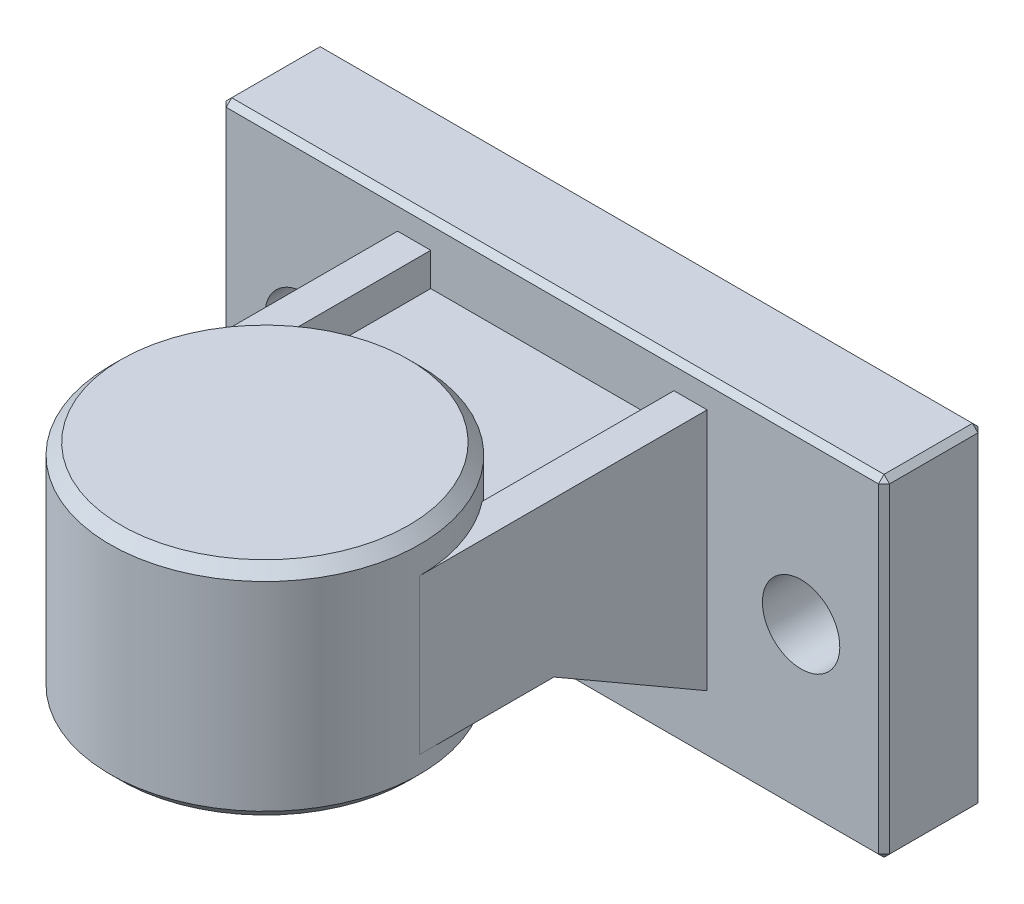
ISO-10303-21;
HEADER;
FILE_DESCRIPTION(('STEP AP214'),'2;1');
FILE_NAME('part.step','',(''),(''),'','','');
FILE_SCHEMA(('AUTOMOTIVE_DESIGN { 1 0 10303 214 1 1 1 1 }'));
ENDSEC;
DATA;
#1=APPLICATION_CONTEXT('core data for automotive mechanical design processes');
#2=APPLICATION_PROTOCOL_DEFINITION('international standard','automotive_design',2000,#1);
#3=PRODUCT_CONTEXT('',#1,'mechanical');
#4=PRODUCT('Part','Part','',(#3));
#5=PRODUCT_RELATED_PRODUCT_CATEGORY('part','',(#4));
#6=PRODUCT_DEFINITION_FORMATION('','',#4);
#7=PRODUCT_DEFINITION_CONTEXT('part definition',#1,'design');
#8=PRODUCT_DEFINITION('design','',#6,#7);
#9=PRODUCT_DEFINITION_SHAPE('','',#8);
#10=(LENGTH_UNIT() NAMED_UNIT(*) SI_UNIT(.MILLI.,.METRE.));
#11=(NAMED_UNIT(*) PLANE_ANGLE_UNIT() SI_UNIT($,.RADIAN.));
#12=(NAMED_UNIT(*) SI_UNIT($,.STERADIAN.) SOLID_ANGLE_UNIT());
#13=UNCERTAINTY_MEASURE_WITH_UNIT(LENGTH_MEASURE(1.E-05),#10,'distance_accuracy_value','');
#14=(GEOMETRIC_REPRESENTATION_CONTEXT(3) GLOBAL_UNCERTAINTY_ASSIGNED_CONTEXT((#13)) GLOBAL_UNIT_ASSIGNED_CONTEXT((#10,
#11,#12)) REPRESENTATION_CONTEXT('',''));
#15=CARTESIAN_POINT('',(0.,0.,0.));
#16=DIRECTION('',(0.,0.,1.));
#17=DIRECTION('',(1.,0.,0.));
#18=AXIS2_PLACEMENT_3D('',#15,#16,#17);
#19=CARTESIAN_POINT('',(8.5,-1.45,35.));
#20=DIRECTION('',(0.,-1.,0.));
#21=DIRECTION('',(0.,0.,1.));
#22=AXIS2_PLACEMENT_3D('',#19,#20,#21);
#23=PLANE('',#22);
#24=DIRECTION('',(0.,0.,-1.));
#25=VECTOR('',#24,1.);
#26=CARTESIAN_POINT('',(11.5,-1.45,26.3397459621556));
#27=LINE('',#26,#25);
#28=CARTESIAN_POINT('',(11.5,-1.45,26.3397459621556));
#29=VERTEX_POINT('',#28);
#30=CARTESIAN_POINT('',(11.5,-1.45,22.8564064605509));
#31=VERTEX_POINT('',#30);
#32=EDGE_CURVE('E198',#29,#31,#27,.T.);
#33=ORIENTED_EDGE('',*,*,#32,.F.);
#34=CARTESIAN_POINT('',(22.5,-1.45,35.));
#35=DIRECTION('',(0.,-1.,0.));
#36=DIRECTION('',(0.,0.,1.));
#37=AXIS2_PLACEMENT_3D('',#34,#35,#36);
#38=CIRCLE('',#37,14.);
#39=CARTESIAN_POINT('',(8.5,-1.45,35.));
#40=VERTEX_POINT('',#39);
#41=EDGE_CURVE('E215',#40,#29,#38,.T.);
#42=ORIENTED_EDGE('',*,*,#41,.F.);
#43=DIRECTION('',(0.,0.,-1.));
#44=VECTOR('',#43,1.);
#45=CARTESIAN_POINT('',(8.5,-1.45,35.));
#46=LINE('',#45,#44);
#47=CARTESIAN_POINT('',(8.5,-1.45,22.8564064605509));
#48=VERTEX_POINT('',#47);
#49=EDGE_CURVE('E238',#40,#48,#46,.T.);
#50=ORIENTED_EDGE('',*,*,#49,.T.);
#51=DIRECTION('',(-1.,0.,0.));
#52=VECTOR('',#51,1.);
#53=CARTESIAN_POINT('',(11.5,-1.45,22.8564064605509));
#54=LINE('',#53,#52);
#55=EDGE_CURVE('E216',#31,#48,#54,.T.);
#56=ORIENTED_EDGE('',*,*,#55,.F.);
#57=EDGE_LOOP('',(#33,#42,#50,#56));
#58=FACE_BOUND('',#57,.T.);
#59=ADVANCED_FACE('F14',(#58),#23,.T.);
#60=CARTESIAN_POINT('',(8.5,12.55,35.));
#61=DIRECTION('',(0.,-1.,0.));
#62=DIRECTION('',(0.,0.,1.));
#63=AXIS2_PLACEMENT_3D('',#60,#61,#62);
#64=PLANE('',#63);
#65=DIRECTION('',(0.,0.,-1.));
#66=VECTOR('',#65,1.);
#67=CARTESIAN_POINT('',(11.5,12.55,26.3397459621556));
#68=LINE('',#67,#66);
#69=CARTESIAN_POINT('',(11.5,12.55,26.3397459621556));
#70=VERTEX_POINT('',#69);
#71=CARTESIAN_POINT('',(11.5,12.55,9.));
#72=VERTEX_POINT('',#71);
#73=EDGE_CURVE('E931',#70,#72,#68,.T.);
#74=ORIENTED_EDGE('',*,*,#73,.T.);
#75=DIRECTION('',(1.,0.,0.));
#76=VECTOR('',#75,1.);
#77=CARTESIAN_POINT('',(8.5,12.55,9.));
#78=LINE('',#77,#76);
#79=CARTESIAN_POINT('',(8.5,12.55,9.));
#80=VERTEX_POINT('',#79);
#81=EDGE_CURVE('E246',#80,#72,#78,.T.);
#82=ORIENTED_EDGE('',*,*,#81,.F.);
#83=DIRECTION('',(0.,0.,-1.));
#84=VECTOR('',#83,1.);
#85=CARTESIAN_POINT('',(8.5,12.55,35.));
#86=LINE('',#85,#84);
#87=CARTESIAN_POINT('',(8.5,12.55,35.));
#88=VERTEX_POINT('',#87);
#89=EDGE_CURVE('E242',#88,#80,#86,.T.);
#90=ORIENTED_EDGE('',*,*,#89,.F.);
#91=CARTESIAN_POINT('',(22.5,12.55,35.));
#92=DIRECTION('',(0.,-1.,0.));
#93=DIRECTION('',(0.,0.,1.));
#94=AXIS2_PLACEMENT_3D('',#91,#92,#93);
#95=CIRCLE('',#94,14.);
#96=EDGE_CURVE('E225',#88,#70,#95,.T.);
#97=ORIENTED_EDGE('',*,*,#96,.T.);
#98=EDGE_LOOP('',(#74,#82,#90,#97));
#99=FACE_BOUND('',#98,.T.);
#100=ADVANCED_FACE('F476',(#99),#64,.F.);
#101=DIRECTION('',(0.,0.,1.));
#102=VECTOR('',#101,1.);
#103=CARTESIAN_POINT('',(33.5,-1.45,9.));
#104=LINE('',#103,#102);
#105=CARTESIAN_POINT('',(33.5,-1.45,22.8564064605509));
#106=VERTEX_POINT('',#105);
#107=CARTESIAN_POINT('',(33.5,-1.45,26.3397459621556));
#108=VERTEX_POINT('',#107);
#109=EDGE_CURVE('E186',#106,#108,#104,.T.);
#110=ORIENTED_EDGE('',*,*,#109,.F.);
#111=DIRECTION('',(1.,0.,0.));
#112=VECTOR('',#111,1.);
#113=CARTESIAN_POINT('',(33.5,-1.45,22.8564064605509));
#114=LINE('',#113,#112);
#115=CARTESIAN_POINT('',(36.5,-1.45,22.8564064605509));
#116=VERTEX_POINT('',#115);
#117=EDGE_CURVE('E910',#106,#116,#114,.T.);
#118=ORIENTED_EDGE('',*,*,#117,.T.);
#119=DIRECTION('',(0.,0.,-1.));
#120=VECTOR('',#119,1.);
#121=CARTESIAN_POINT('',(36.5,-1.45,35.));
#122=LINE('',#121,#120);
#123=CARTESIAN_POINT('',(36.5,-1.45,35.));
#124=VERTEX_POINT('',#123);
#125=EDGE_CURVE('E214',#124,#116,#122,.T.);
#126=ORIENTED_EDGE('',*,*,#125,.F.);
#127=EDGE_CURVE('E204',#108,#124,#38,.T.);
#128=ORIENTED_EDGE('',*,*,#127,.F.);
#129=EDGE_LOOP('',(#110,#118,#126,#128));
#130=FACE_BOUND('',#129,.T.);
#131=ADVANCED_FACE('F212',(#130),#23,.T.);
#132=CARTESIAN_POINT('',(52.5,15.,9.));
#133=DIRECTION('',(0.,0.,-1.));
#134=DIRECTION('',(0.,-1.,0.));
#135=AXIS2_PLACEMENT_3D('',#132,#133,#134);
#136=PLANE('',#135);
#137=DIRECTION('',(-1.,0.,0.));
#138=VECTOR('',#137,1.);
#139=CARTESIAN_POINT('',(-7.5,14.5,9.));
#140=LINE('',#139,#138);
#141=CARTESIAN_POINT('',(52.,14.5,9.));
#142=VERTEX_POINT('',#141);
#143=CARTESIAN_POINT('',(-7.,14.5,9.));
#144=VERTEX_POINT('',#143);
#145=EDGE_CURVE('E277',#142,#144,#140,.T.);
#146=ORIENTED_EDGE('',*,*,#145,.T.);
#147=DIRECTION('',(0.,-1.,0.));
#148=VECTOR('',#147,1.);
#149=CARTESIAN_POINT('',(-7.,15.,9.));
#150=LINE('',#149,#148);
#151=CARTESIAN_POINT('',(-7.,-14.5,9.));
#152=VERTEX_POINT('',#151);
#153=EDGE_CURVE('E279',#144,#152,#150,.T.);
#154=ORIENTED_EDGE('',*,*,#153,.T.);
#155=DIRECTION('',(1.,0.,0.));
#156=VECTOR('',#155,1.);
#157=CARTESIAN_POINT('',(52.5,-14.5,9.));
#158=LINE('',#157,#156);
#159=CARTESIAN_POINT('',(52.,-14.5,9.));
#160=VERTEX_POINT('',#159);
#161=EDGE_CURVE('E273',#152,#160,#158,.T.);
#162=ORIENTED_EDGE('',*,*,#161,.T.);
#163=DIRECTION('',(0.,1.,0.));
#164=VECTOR('',#163,1.);
#165=CARTESIAN_POINT('',(52.,15.,9.));
#166=LINE('',#165,#164);
#167=EDGE_CURVE('E275',#160,#142,#166,.T.);
#168=ORIENTED_EDGE('',*,*,#167,.T.);
#169=EDGE_LOOP('',(#146,#154,#162,#168));
#170=FACE_BOUND('',#169,.T.);
#171=CARTESIAN_POINT('',(45.,0.,9.));
#172=DIRECTION('',(0.,0.,1.));
#173=DIRECTION('',(0.,1.,0.));
#174=AXIS2_PLACEMENT_3D('',#171,#172,#173);
#175=CIRCLE('',#174,3.5);
#176=CARTESIAN_POINT('',(45.,3.5,9.));
#177=VERTEX_POINT('',#176);
#178=EDGE_CURVE('E258',#177,#177,#175,.T.);
#179=ORIENTED_EDGE('',*,*,#178,.F.);
#180=EDGE_LOOP('',(#179));
#181=FACE_BOUND('',#180,.T.);
#182=CARTESIAN_POINT('',(0.,0.,9.));
#183=DIRECTION('',(0.,0.,-1.));
#184=DIRECTION('',(0.,-1.,0.));
#185=AXIS2_PLACEMENT_3D('',#182,#183,#184);
#186=CIRCLE('',#185,3.5);
#187=CARTESIAN_POINT('',(0.,-3.5,9.));
#188=VERTEX_POINT('',#187);
#189=EDGE_CURVE('E252',#188,#188,#186,.T.);
#190=ORIENTED_EDGE('',*,*,#189,.T.);
#191=EDGE_LOOP('',(#190));
#192=FACE_BOUND('',#191,.T.);
#193=DIRECTION('',(1.,0.,0.));
#194=VECTOR('',#193,1.);
#195=CARTESIAN_POINT('',(33.5,-9.45,9.));
#196=LINE('',#195,#194);
#197=CARTESIAN_POINT('',(33.5,-9.45,9.));
#198=VERTEX_POINT('',#197);
#199=CARTESIAN_POINT('',(36.5,-9.45,9.));
#200=VERTEX_POINT('',#199);
#201=EDGE_CURVE('E903',#198,#200,#196,.T.);
#202=ORIENTED_EDGE('',*,*,#201,.F.);
#203=DIRECTION('',(0.,-1.,0.));
#204=VECTOR('',#203,1.);
#205=CARTESIAN_POINT('',(33.5,-1.45,9.));
#206=LINE('',#205,#204);
#207=CARTESIAN_POINT('',(33.5,1.55,9.));
#208=VERTEX_POINT('',#207);
#209=EDGE_CURVE('E905',#208,#198,#206,.T.);
#210=ORIENTED_EDGE('',*,*,#209,.F.);
#211=DIRECTION('',(1.,0.,0.));
#212=VECTOR('',#211,1.);
#213=CARTESIAN_POINT('',(11.5,1.55,9.));
#214=LINE('',#213,#212);
#215=CARTESIAN_POINT('',(11.5,1.55,9.));
#216=VERTEX_POINT('',#215);
#217=EDGE_CURVE('E975',#216,#208,#214,.T.);
#218=ORIENTED_EDGE('',*,*,#217,.F.);
#219=DIRECTION('',(0.,-1.,0.));
#220=VECTOR('',#219,1.);
#221=CARTESIAN_POINT('',(11.5,-1.45,9.));
#222=LINE('',#221,#220);
#223=CARTESIAN_POINT('',(11.5,-9.45,9.));
#224=VERTEX_POINT('',#223);
#225=EDGE_CURVE('E913',#216,#224,#222,.T.);
#226=ORIENTED_EDGE('',*,*,#225,.T.);
#227=DIRECTION('',(-1.,0.,0.));
#228=VECTOR('',#227,1.);
#229=CARTESIAN_POINT('',(11.5,-9.45,9.));
#230=LINE('',#229,#228);
#231=CARTESIAN_POINT('',(8.5,-9.45,9.));
#232=VERTEX_POINT('',#231);
#233=EDGE_CURVE('E221',#224,#232,#230,.T.);
#234=ORIENTED_EDGE('',*,*,#233,.T.);
#235=DIRECTION('',(0.,-1.,0.));
#236=VECTOR('',#235,1.);
#237=CARTESIAN_POINT('',(8.5,12.55,9.));
#238=LINE('',#237,#236);
#239=EDGE_CURVE('E240',#80,#232,#238,.T.);
#240=ORIENTED_EDGE('',*,*,#239,.F.);
#241=ORIENTED_EDGE('',*,*,#81,.T.);
#242=DIRECTION('',(0.,1.,0.));
#243=VECTOR('',#242,1.);
#244=CARTESIAN_POINT('',(11.5,9.55,9.));
#245=LINE('',#244,#243);
#246=CARTESIAN_POINT('',(11.5,9.55,9.));
#247=VERTEX_POINT('',#246);
#248=EDGE_CURVE('E933',#247,#72,#245,.T.);
#249=ORIENTED_EDGE('',*,*,#248,.F.);
#250=DIRECTION('',(-1.,0.,0.));
#251=VECTOR('',#250,1.);
#252=CARTESIAN_POINT('',(33.5,9.55,9.));
#253=LINE('',#252,#251);
#254=CARTESIAN_POINT('',(33.5,9.55,9.));
#255=VERTEX_POINT('',#254);
#256=EDGE_CURVE('E935',#255,#247,#253,.T.);
#257=ORIENTED_EDGE('',*,*,#256,.F.);
#258=DIRECTION('',(0.,1.,0.));
#259=VECTOR('',#258,1.);
#260=CARTESIAN_POINT('',(33.5,9.55,9.));
#261=LINE('',#260,#259);
#262=CARTESIAN_POINT('',(33.5,12.55,9.));
#263=VERTEX_POINT('',#262);
#264=EDGE_CURVE('E958',#255,#263,#261,.T.);
#265=ORIENTED_EDGE('',*,*,#264,.T.);
#266=CARTESIAN_POINT('',(36.5,12.55,9.));
#267=VERTEX_POINT('',#266);
#268=EDGE_CURVE('E245',#263,#267,#78,.T.);
#269=ORIENTED_EDGE('',*,*,#268,.T.);
#270=DIRECTION('',(0.,-1.,0.));
#271=VECTOR('',#270,1.);
#272=CARTESIAN_POINT('',(36.5,12.55,9.));
#273=LINE('',#272,#271);
#274=EDGE_CURVE('E231',#267,#200,#273,.T.);
#275=ORIENTED_EDGE('',*,*,#274,.T.);
#276=EDGE_LOOP('',(#202,#210,#218,#226,#234,#240,#241,#249,#257,#265,#269,#275));
#277=FACE_BOUND('',#276,.T.);
#278=ADVANCED_FACE('F489',(#170,#181,#192,#277),#136,.F.);
#279=CARTESIAN_POINT('',(52.5,15.,0.));
#280=DIRECTION('',(0.,0.,-1.));
#281=DIRECTION('',(0.,-1.,0.));
#282=AXIS2_PLACEMENT_3D('',#279,#280,#281);
#283=PLANE('',#282);
#284=DIRECTION('',(1.,0.,0.));
#285=VECTOR('',#284,1.);
#286=CARTESIAN_POINT('',(52.5,14.5,0.));
#287=LINE('',#286,#285);
#288=CARTESIAN_POINT('',(-7.,14.5,0.));
#289=VERTEX_POINT('',#288);
#290=CARTESIAN_POINT('',(52.,14.5,0.));
#291=VERTEX_POINT('',#290);
#292=EDGE_CURVE('E318',#289,#291,#287,.T.);
#293=ORIENTED_EDGE('',*,*,#292,.T.);
#294=DIRECTION('',(0.,-1.,0.));
#295=VECTOR('',#294,1.);
#296=CARTESIAN_POINT('',(52.,-15.,0.));
#297=LINE('',#296,#295);
#298=CARTESIAN_POINT('',(52.,-14.5,0.));
#299=VERTEX_POINT('',#298);
#300=EDGE_CURVE('E9',#291,#299,#297,.T.);
#301=ORIENTED_EDGE('',*,*,#300,.T.);
#302=DIRECTION('',(-1.,0.,0.));
#303=VECTOR('',#302,1.);
#304=CARTESIAN_POINT('',(52.5,-14.5,0.));
#305=LINE('',#304,#303);
#306=CARTESIAN_POINT('',(-7.,-14.5,0.));
#307=VERTEX_POINT('',#306);
#308=EDGE_CURVE('E23',#299,#307,#305,.T.);
#309=ORIENTED_EDGE('',*,*,#308,.T.);
#310=DIRECTION('',(0.,1.,0.));
#311=VECTOR('',#310,1.);
#312=CARTESIAN_POINT('',(-7.,15.,0.));
#313=LINE('',#312,#311);
#314=EDGE_CURVE('E320',#307,#289,#313,.T.);
#315=ORIENTED_EDGE('',*,*,#314,.T.);
#316=EDGE_LOOP('',(#293,#301,#309,#315));
#317=FACE_BOUND('',#316,.T.);
#318=CARTESIAN_POINT('',(0.,0.,0.));
#319=DIRECTION('',(0.,0.,-1.));
#320=DIRECTION('',(0.,-1.,0.));
#321=AXIS2_PLACEMENT_3D('',#318,#319,#320);
#322=CIRCLE('',#321,3.5);
#323=CARTESIAN_POINT('',(0.,-3.5,0.));
#324=VERTEX_POINT('',#323);
#325=EDGE_CURVE('E249',#324,#324,#322,.T.);
#326=ORIENTED_EDGE('',*,*,#325,.F.);
#327=EDGE_LOOP('',(#326));
#328=FACE_BOUND('',#327,.T.);
#329=CARTESIAN_POINT('',(45.,0.,0.));
#330=DIRECTION('',(0.,0.,1.));
#331=DIRECTION('',(0.,1.,0.));
#332=AXIS2_PLACEMENT_3D('',#329,#330,#331);
#333=CIRCLE('',#332,3.5);
#334=CARTESIAN_POINT('',(45.,3.5,0.));
#335=VERTEX_POINT('',#334);
#336=EDGE_CURVE('E255',#335,#335,#333,.T.);
#337=ORIENTED_EDGE('',*,*,#336,.T.);
#338=EDGE_LOOP('',(#337));
#339=FACE_BOUND('',#338,.T.);
#340=ADVANCED_FACE('F416',(#317,#328,#339),#283,.T.);
#341=CARTESIAN_POINT('',(52.5,-15.,9.));
#342=DIRECTION('',(-1.,0.,0.));
#343=DIRECTION('',(0.,-1.,0.));
#344=AXIS2_PLACEMENT_3D('',#341,#342,#343);
#345=PLANE('',#344);
#346=DIRECTION('',(0.,1.,0.));
#347=VECTOR('',#346,1.);
#348=CARTESIAN_POINT('',(52.5,15.,0.499999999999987));
#349=LINE('',#348,#347);
#350=CARTESIAN_POINT('',(52.5,-14.5,0.499999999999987));
#351=VERTEX_POINT('',#350);
#352=CARTESIAN_POINT('',(52.5,14.5,0.499999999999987));
#353=VERTEX_POINT('',#352);
#354=EDGE_CURVE('E300',#351,#353,#349,.T.);
#355=ORIENTED_EDGE('',*,*,#354,.T.);
#356=DIRECTION('',(0.,0.,1.));
#357=VECTOR('',#356,1.);
#358=CARTESIAN_POINT('',(52.5,14.5,9.));
#359=LINE('',#358,#357);
#360=CARTESIAN_POINT('',(52.5,14.5,8.5));
#361=VERTEX_POINT('',#360);
#362=EDGE_CURVE('E306',#353,#361,#359,.T.);
#363=ORIENTED_EDGE('',*,*,#362,.T.);
#364=DIRECTION('',(0.,-1.,0.));
#365=VECTOR('',#364,1.);
#366=CARTESIAN_POINT('',(52.5,-15.,8.5));
#367=LINE('',#366,#365);
#368=CARTESIAN_POINT('',(52.5,-14.5,8.5));
#369=VERTEX_POINT('',#368);
#370=EDGE_CURVE('E304',#361,#369,#367,.T.);
#371=ORIENTED_EDGE('',*,*,#370,.T.);
#372=DIRECTION('',(0.,0.,-1.));
#373=VECTOR('',#372,1.);
#374=CARTESIAN_POINT('',(52.5,-14.5,0.));
#375=LINE('',#374,#373);
#376=EDGE_CURVE('E302',#369,#351,#375,.T.);
#377=ORIENTED_EDGE('',*,*,#376,.T.);
#378=EDGE_LOOP('',(#355,#363,#371,#377));
#379=FACE_BOUND('',#378,.T.);
#380=ADVANCED_FACE('F414',(#379),#345,.F.);
#381=CARTESIAN_POINT('',(-7.5,15.,9.));
#382=DIRECTION('',(0.,1.,0.));
#383=DIRECTION('',(-1.,0.,0.));
#384=AXIS2_PLACEMENT_3D('',#381,#382,#383);
#385=PLANE('',#384);
#386=DIRECTION('',(0.,0.,1.));
#387=VECTOR('',#386,1.);
#388=CARTESIAN_POINT('',(-7.,15.,9.));
#389=LINE('',#388,#387);
#390=CARTESIAN_POINT('',(-7.,15.,0.499999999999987));
#391=VERTEX_POINT('',#390);
#392=CARTESIAN_POINT('',(-7.,15.,8.5));
#393=VERTEX_POINT('',#392);
#394=EDGE_CURVE('E293',#391,#393,#389,.T.);
#395=ORIENTED_EDGE('',*,*,#394,.T.);
#396=DIRECTION('',(1.,0.,0.));
#397=VECTOR('',#396,1.);
#398=CARTESIAN_POINT('',(52.5,15.,8.5));
#399=LINE('',#398,#397);
#400=CARTESIAN_POINT('',(52.,15.,8.5));
#401=VERTEX_POINT('',#400);
#402=EDGE_CURVE('E297',#393,#401,#399,.T.);
#403=ORIENTED_EDGE('',*,*,#402,.T.);
#404=DIRECTION('',(0.,0.,-1.));
#405=VECTOR('',#404,1.);
#406=CARTESIAN_POINT('',(52.,15.,0.));
#407=LINE('',#406,#405);
#408=CARTESIAN_POINT('',(52.,15.,0.499999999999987));
#409=VERTEX_POINT('',#408);
#410=EDGE_CURVE('E295',#401,#409,#407,.T.);
#411=ORIENTED_EDGE('',*,*,#410,.T.);
#412=DIRECTION('',(-1.,0.,0.));
#413=VECTOR('',#412,1.);
#414=CARTESIAN_POINT('',(-7.5,15.,0.499999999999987));
#415=LINE('',#414,#413);
#416=EDGE_CURVE('E291',#409,#391,#415,.T.);
#417=ORIENTED_EDGE('',*,*,#416,.T.);
#418=EDGE_LOOP('',(#395,#403,#411,#417));
#419=FACE_BOUND('',#418,.T.);
#420=ADVANCED_FACE('F405',(#419),#385,.T.);
#421=CARTESIAN_POINT('',(-7.5,15.,9.));
#422=DIRECTION('',(1.,0.,0.));
#423=DIRECTION('',(0.,1.,0.));
#424=AXIS2_PLACEMENT_3D('',#421,#422,#423);
#425=PLANE('',#424);
#426=DIRECTION('',(0.,0.,1.));
#427=VECTOR('',#426,1.);
#428=CARTESIAN_POINT('',(-7.5,-14.5,9.));
#429=LINE('',#428,#427);
#430=CARTESIAN_POINT('',(-7.5,-14.5,0.499999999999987));
#431=VERTEX_POINT('',#430);
#432=CARTESIAN_POINT('',(-7.5,-14.5,8.5));
#433=VERTEX_POINT('',#432);
#434=EDGE_CURVE('E286',#431,#433,#429,.T.);
#435=ORIENTED_EDGE('',*,*,#434,.T.);
#436=DIRECTION('',(0.,1.,0.));
#437=VECTOR('',#436,1.);
#438=CARTESIAN_POINT('',(-7.5,15.,8.5));
#439=LINE('',#438,#437);
#440=CARTESIAN_POINT('',(-7.5,14.5,8.5));
#441=VERTEX_POINT('',#440);
#442=EDGE_CURVE('E288',#433,#441,#439,.T.);
#443=ORIENTED_EDGE('',*,*,#442,.T.);
#444=DIRECTION('',(0.,0.,-1.));
#445=VECTOR('',#444,1.);
#446=CARTESIAN_POINT('',(-7.5,14.5,0.));
#447=LINE('',#446,#445);
#448=CARTESIAN_POINT('',(-7.5,14.5,0.499999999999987));
#449=VERTEX_POINT('',#448);
#450=EDGE_CURVE('E282',#441,#449,#447,.T.);
#451=ORIENTED_EDGE('',*,*,#450,.T.);
#452=DIRECTION('',(0.,-1.,0.));
#453=VECTOR('',#452,1.);
#454=CARTESIAN_POINT('',(-7.5,-15.,0.499999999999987));
#455=LINE('',#454,#453);
#456=EDGE_CURVE('E284',#449,#431,#455,.T.);
#457=ORIENTED_EDGE('',*,*,#456,.T.);
#458=EDGE_LOOP('',(#435,#443,#451,#457));
#459=FACE_BOUND('',#458,.T.);
#460=ADVANCED_FACE('F434',(#459),#425,.F.);
#461=CARTESIAN_POINT('',(52.5,-15.,9.));
#462=DIRECTION('',(0.,-1.,0.));
#463=DIRECTION('',(1.,0.,0.));
#464=AXIS2_PLACEMENT_3D('',#461,#462,#463);
#465=PLANE('',#464);
#466=DIRECTION('',(0.,0.,1.));
#467=VECTOR('',#466,1.);
#468=CARTESIAN_POINT('',(52.,-15.,9.));
#469=LINE('',#468,#467);
#470=CARTESIAN_POINT('',(52.,-15.,0.499999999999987));
#471=VERTEX_POINT('',#470);
#472=CARTESIAN_POINT('',(52.,-15.,8.5));
#473=VERTEX_POINT('',#472);
#474=EDGE_CURVE('E313',#471,#473,#469,.T.);
#475=ORIENTED_EDGE('',*,*,#474,.T.);
#476=DIRECTION('',(-1.,0.,0.));
#477=VECTOR('',#476,1.);
#478=CARTESIAN_POINT('',(-7.5,-15.,8.5));
#479=LINE('',#478,#477);
#480=CARTESIAN_POINT('',(-7.,-15.,8.5));
#481=VERTEX_POINT('',#480);
#482=EDGE_CURVE('E315',#473,#481,#479,.T.);
#483=ORIENTED_EDGE('',*,*,#482,.T.);
#484=DIRECTION('',(0.,0.,-1.));
#485=VECTOR('',#484,1.);
#486=CARTESIAN_POINT('',(-7.,-15.,0.));
#487=LINE('',#486,#485);
#488=CARTESIAN_POINT('',(-7.,-15.,0.499999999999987));
#489=VERTEX_POINT('',#488);
#490=EDGE_CURVE('E311',#481,#489,#487,.T.);
#491=ORIENTED_EDGE('',*,*,#490,.T.);
#492=DIRECTION('',(1.,0.,0.));
#493=VECTOR('',#492,1.);
#494=CARTESIAN_POINT('',(52.5,-15.,0.499999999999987));
#495=LINE('',#494,#493);
#496=EDGE_CURVE('E309',#489,#471,#495,.T.);
#497=ORIENTED_EDGE('',*,*,#496,.T.);
#498=EDGE_LOOP('',(#475,#483,#491,#497));
#499=FACE_BOUND('',#498,.T.);
#500=ADVANCED_FACE('F506',(#499),#465,.T.);
#501=CARTESIAN_POINT('',(45.,0.,9.));
#502=DIRECTION('',(0.,0.,-1.));
#503=DIRECTION('',(0.,-1.,0.));
#504=AXIS2_PLACEMENT_3D('',#501,#502,#503);
#505=CYLINDRICAL_SURFACE('',#504,3.5);
#506=ORIENTED_EDGE('',*,*,#178,.T.);
#507=EDGE_LOOP('',(#506));
#508=FACE_BOUND('',#507,.T.);
#509=ORIENTED_EDGE('',*,*,#336,.F.);
#510=EDGE_LOOP('',(#509));
#511=FACE_BOUND('',#510,.T.);
#512=ADVANCED_FACE('F509',(#508,#511),#505,.F.);
#513=CARTESIAN_POINT('',(0.,0.,9.));
#514=DIRECTION('',(0.,0.,-1.));
#515=DIRECTION('',(0.,-1.,0.));
#516=AXIS2_PLACEMENT_3D('',#513,#514,#515);
#517=CYLINDRICAL_SURFACE('',#516,3.5);
#518=ORIENTED_EDGE('',*,*,#189,.F.);
#519=EDGE_LOOP('',(#518));
#520=FACE_BOUND('',#519,.T.);
#521=ORIENTED_EDGE('',*,*,#325,.T.);
#522=EDGE_LOOP('',(#521));
#523=FACE_BOUND('',#522,.T.);
#524=ADVANCED_FACE('F859',(#520,#523),#517,.F.);
#525=ORIENTED_EDGE('',*,*,#268,.F.);
#526=DIRECTION('',(0.,0.,-1.));
#527=VECTOR('',#526,1.);
#528=CARTESIAN_POINT('',(33.5,12.55,26.3397459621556));
#529=LINE('',#528,#527);
#530=CARTESIAN_POINT('',(33.5,12.55,26.3397459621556));
#531=VERTEX_POINT('',#530);
#532=EDGE_CURVE('E946',#531,#263,#529,.T.);
#533=ORIENTED_EDGE('',*,*,#532,.F.);
#534=CARTESIAN_POINT('',(36.5,12.55,35.));
#535=VERTEX_POINT('',#534);
#536=EDGE_CURVE('E219',#531,#535,#95,.T.);
#537=ORIENTED_EDGE('',*,*,#536,.T.);
#538=DIRECTION('',(0.,0.,-1.));
#539=VECTOR('',#538,1.);
#540=CARTESIAN_POINT('',(36.5,12.55,35.));
#541=LINE('',#540,#539);
#542=EDGE_CURVE('E233',#535,#267,#541,.T.);
#543=ORIENTED_EDGE('',*,*,#542,.T.);
#544=EDGE_LOOP('',(#525,#533,#537,#543));
#545=FACE_BOUND('',#544,.T.);
#546=ADVANCED_FACE('F485',(#545),#64,.F.);
#547=CARTESIAN_POINT('',(8.5,-1.45,35.));
#548=DIRECTION('',(1.,0.,0.));
#549=DIRECTION('',(0.,1.,0.));
#550=AXIS2_PLACEMENT_3D('',#547,#548,#549);
#551=PLANE('',#550);
#552=DIRECTION('',(0.,-1.,0.));
#553=VECTOR('',#552,1.);
#554=CARTESIAN_POINT('',(8.5,12.55,35.));
#555=LINE('',#554,#553);
#556=EDGE_CURVE('E236',#88,#40,#555,.T.);
#557=ORIENTED_EDGE('',*,*,#556,.F.);
#558=ORIENTED_EDGE('',*,*,#89,.T.);
#559=ORIENTED_EDGE('',*,*,#239,.T.);
#560=DIRECTION('',(0.,0.5,0.866025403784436));
#561=VECTOR('',#560,1.);
#562=CARTESIAN_POINT('',(8.5,-9.45,9.));
#563=LINE('',#562,#561);
#564=EDGE_CURVE('E909',#232,#48,#563,.T.);
#565=ORIENTED_EDGE('',*,*,#564,.T.);
#566=ORIENTED_EDGE('',*,*,#49,.F.);
#567=EDGE_LOOP('',(#557,#558,#559,#565,#566));
#568=FACE_BOUND('',#567,.T.);
#569=ADVANCED_FACE('F843',(#568),#551,.F.);
#570=CARTESIAN_POINT('',(36.5,-1.45,35.));
#571=DIRECTION('',(1.,0.,0.));
#572=DIRECTION('',(0.,1.,0.));
#573=AXIS2_PLACEMENT_3D('',#570,#571,#572);
#574=PLANE('',#573);
#575=DIRECTION('',(0.,-1.,0.));
#576=VECTOR('',#575,1.);
#577=CARTESIAN_POINT('',(36.5,12.55,35.));
#578=LINE('',#577,#576);
#579=EDGE_CURVE('E228',#535,#124,#578,.T.);
#580=ORIENTED_EDGE('',*,*,#579,.T.);
#581=ORIENTED_EDGE('',*,*,#125,.T.);
#582=DIRECTION('',(0.,0.5,0.866025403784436));
#583=VECTOR('',#582,1.);
#584=CARTESIAN_POINT('',(36.5,-9.45,9.));
#585=LINE('',#584,#583);
#586=EDGE_CURVE('E960',#200,#116,#585,.T.);
#587=ORIENTED_EDGE('',*,*,#586,.F.);
#588=ORIENTED_EDGE('',*,*,#274,.F.);
#589=ORIENTED_EDGE('',*,*,#542,.F.);
#590=EDGE_LOOP('',(#580,#581,#587,#588,#589));
#591=FACE_BOUND('',#590,.T.);
#592=ADVANCED_FACE('F828',(#591),#574,.T.);
#593=CARTESIAN_POINT('',(22.5,-4.,35.));
#594=DIRECTION('',(0.,1.,0.));
#595=DIRECTION('',(-1.,0.,0.));
#596=AXIS2_PLACEMENT_3D('',#593,#594,#595);
#597=CYLINDRICAL_SURFACE('',#596,14.);
#598=CARTESIAN_POINT('',(22.5,15.,35.));
#599=DIRECTION('',(0.,1.,0.));
#600=DIRECTION('',(-1.,0.,0.));
#601=AXIS2_PLACEMENT_3D('',#598,#599,#600);
#602=CIRCLE('',#601,14.);
#603=CARTESIAN_POINT('',(8.5,15.,35.));
#604=VERTEX_POINT('',#603);
#605=EDGE_CURVE('E267',#604,#604,#602,.F.);
#606=ORIENTED_EDGE('',*,*,#605,.T.);
#607=EDGE_LOOP('',(#606));
#608=FACE_BOUND('',#607,.T.);
#609=CARTESIAN_POINT('',(22.5,-3.,35.));
#610=DIRECTION('',(0.,1.,0.));
#611=DIRECTION('',(-1.,0.,0.));
#612=AXIS2_PLACEMENT_3D('',#609,#610,#611);
#613=CIRCLE('',#612,14.);
#614=CARTESIAN_POINT('',(8.5,-3.,35.));
#615=VERTEX_POINT('',#614);
#616=EDGE_CURVE('E264',#615,#615,#613,.T.);
#617=ORIENTED_EDGE('',*,*,#616,.T.);
#618=EDGE_LOOP('',(#617));
#619=FACE_BOUND('',#618,.T.);
#620=ORIENTED_EDGE('',*,*,#96,.F.);
#621=ORIENTED_EDGE('',*,*,#556,.T.);
#622=ORIENTED_EDGE('',*,*,#41,.T.);
#623=DIRECTION('',(0.,-1.,0.));
#624=VECTOR('',#623,1.);
#625=CARTESIAN_POINT('',(11.5,1.55,26.3397459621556));
#626=LINE('',#625,#624);
#627=CARTESIAN_POINT('',(11.5,1.55,26.3397459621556));
#628=VERTEX_POINT('',#627);
#629=EDGE_CURVE('E208',#628,#29,#626,.T.);
#630=ORIENTED_EDGE('',*,*,#629,.F.);
#631=CARTESIAN_POINT('',(22.5,1.55,35.));
#632=DIRECTION('',(0.,-1.,0.));
#633=DIRECTION('',(0.,0.,1.));
#634=AXIS2_PLACEMENT_3D('',#631,#632,#633);
#635=CIRCLE('',#634,14.);
#636=CARTESIAN_POINT('',(33.5,1.55,26.3397459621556));
#637=VERTEX_POINT('',#636);
#638=EDGE_CURVE('E207',#628,#637,#635,.T.);
#639=ORIENTED_EDGE('',*,*,#638,.T.);
#640=DIRECTION('',(0.,-1.,0.));
#641=VECTOR('',#640,1.);
#642=CARTESIAN_POINT('',(33.5,1.55,26.3397459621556));
#643=LINE('',#642,#641);
#644=EDGE_CURVE('E190',#637,#108,#643,.T.);
#645=ORIENTED_EDGE('',*,*,#644,.T.);
#646=ORIENTED_EDGE('',*,*,#127,.T.);
#647=ORIENTED_EDGE('',*,*,#579,.F.);
#648=ORIENTED_EDGE('',*,*,#536,.F.);
#649=DIRECTION('',(0.,1.,0.));
#650=VECTOR('',#649,1.);
#651=CARTESIAN_POINT('',(33.5,9.55,26.3397459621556));
#652=LINE('',#651,#650);
#653=CARTESIAN_POINT('',(33.5,9.55,26.3397459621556));
#654=VERTEX_POINT('',#653);
#655=EDGE_CURVE('E956',#654,#531,#652,.T.);
#656=ORIENTED_EDGE('',*,*,#655,.F.);
#657=CARTESIAN_POINT('',(22.5,9.55,35.));
#658=DIRECTION('',(0.,1.,0.));
#659=DIRECTION('',(-1.,0.,0.));
#660=AXIS2_PLACEMENT_3D('',#657,#658,#659);
#661=CIRCLE('',#660,14.);
#662=CARTESIAN_POINT('',(11.5,9.55,26.3397459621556));
#663=VERTEX_POINT('',#662);
#664=EDGE_CURVE('E949',#654,#663,#661,.T.);
#665=ORIENTED_EDGE('',*,*,#664,.T.);
#666=DIRECTION('',(0.,1.,0.));
#667=VECTOR('',#666,1.);
#668=CARTESIAN_POINT('',(11.5,9.55,26.3397459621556));
#669=LINE('',#668,#667);
#670=EDGE_CURVE('E938',#663,#70,#669,.T.);
#671=ORIENTED_EDGE('',*,*,#670,.T.);
#672=EDGE_LOOP('',(#620,#621,#622,#630,#639,#645,#646,#647,#648,#656,#665,#671));
#673=FACE_BOUND('',#672,.T.);
#674=ADVANCED_FACE('F202',(#608,#619,#673),#597,.T.);
#675=CARTESIAN_POINT('',(22.5,-4.,35.));
#676=DIRECTION('',(0.,1.,0.));
#677=DIRECTION('',(-1.,0.,0.));
#678=AXIS2_PLACEMENT_3D('',#675,#676,#677);
#679=PLANE('',#678);
#680=CARTESIAN_POINT('',(22.5,-4.,35.));
#681=DIRECTION('',(0.,1.,0.));
#682=DIRECTION('',(-1.,0.,0.));
#683=AXIS2_PLACEMENT_3D('',#680,#681,#682);
#684=CIRCLE('',#683,13.);
#685=CARTESIAN_POINT('',(9.5,-4.,35.));
#686=VERTEX_POINT('',#685);
#687=EDGE_CURVE('E270',#686,#686,#684,.F.);
#688=ORIENTED_EDGE('',*,*,#687,.T.);
#689=EDGE_LOOP('',(#688));
#690=FACE_BOUND('',#689,.T.);
#691=ADVANCED_FACE('F817',(#690),#679,.F.);
#692=CARTESIAN_POINT('',(22.5,16.,35.));
#693=DIRECTION('',(0.,1.,0.));
#694=DIRECTION('',(-1.,0.,0.));
#695=AXIS2_PLACEMENT_3D('',#692,#693,#694);
#696=PLANE('',#695);
#697=CARTESIAN_POINT('',(22.5,16.,35.));
#698=DIRECTION('',(0.,1.,0.));
#699=DIRECTION('',(-1.,0.,0.));
#700=AXIS2_PLACEMENT_3D('',#697,#698,#699);
#701=CIRCLE('',#700,13.);
#702=CARTESIAN_POINT('',(9.5,16.,35.));
#703=VERTEX_POINT('',#702);
#704=EDGE_CURVE('E261',#703,#703,#701,.T.);
#705=ORIENTED_EDGE('',*,*,#704,.T.);
#706=EDGE_LOOP('',(#705));
#707=FACE_BOUND('',#706,.T.);
#708=ADVANCED_FACE('F802',(#707),#696,.T.);
#709=CARTESIAN_POINT('',(11.5,-9.45,9.));
#710=DIRECTION('',(0.,-0.866025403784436,0.5));
#711=DIRECTION('',(0.,0.5,0.866025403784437));
#712=AXIS2_PLACEMENT_3D('',#709,#710,#711);
#713=PLANE('',#712);
#714=DIRECTION('',(0.,0.5,0.866025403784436));
#715=VECTOR('',#714,1.);
#716=CARTESIAN_POINT('',(11.5,-9.45,9.));
#717=LINE('',#716,#715);
#718=EDGE_CURVE('E919',#224,#31,#717,.T.);
#719=ORIENTED_EDGE('',*,*,#718,.T.);
#720=ORIENTED_EDGE('',*,*,#55,.T.);
#721=ORIENTED_EDGE('',*,*,#564,.F.);
#722=ORIENTED_EDGE('',*,*,#233,.F.);
#723=EDGE_LOOP('',(#719,#720,#721,#722));
#724=FACE_BOUND('',#723,.T.);
#725=ADVANCED_FACE('F793',(#724),#713,.T.);
#726=CARTESIAN_POINT('',(11.5,-1.45,9.));
#727=DIRECTION('',(1.,0.,0.));
#728=DIRECTION('',(0.,1.,0.));
#729=AXIS2_PLACEMENT_3D('',#726,#727,#728);
#730=PLANE('',#729);
#731=ORIENTED_EDGE('',*,*,#225,.F.);
#732=DIRECTION('',(0.,0.,-1.));
#733=VECTOR('',#732,1.);
#734=CARTESIAN_POINT('',(11.5,1.55,26.3397459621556));
#735=LINE('',#734,#733);
#736=EDGE_CURVE('E209',#628,#216,#735,.T.);
#737=ORIENTED_EDGE('',*,*,#736,.F.);
#738=ORIENTED_EDGE('',*,*,#629,.T.);
#739=ORIENTED_EDGE('',*,*,#32,.T.);
#740=ORIENTED_EDGE('',*,*,#718,.F.);
#741=EDGE_LOOP('',(#731,#737,#738,#739,#740));
#742=FACE_BOUND('',#741,.T.);
#743=ADVANCED_FACE('F790',(#742),#730,.T.);
#744=CARTESIAN_POINT('',(33.5,-9.45,9.));
#745=DIRECTION('',(0.,0.866025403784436,-0.5));
#746=DIRECTION('',(0.,-0.5,-0.866025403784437));
#747=AXIS2_PLACEMENT_3D('',#744,#745,#746);
#748=PLANE('',#747);
#749=ORIENTED_EDGE('',*,*,#117,.F.);
#750=DIRECTION('',(0.,0.5,0.866025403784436));
#751=VECTOR('',#750,1.);
#752=CARTESIAN_POINT('',(33.5,-9.45,9.));
#753=LINE('',#752,#751);
#754=EDGE_CURVE('E193',#198,#106,#753,.T.);
#755=ORIENTED_EDGE('',*,*,#754,.F.);
#756=ORIENTED_EDGE('',*,*,#201,.T.);
#757=ORIENTED_EDGE('',*,*,#586,.T.);
#758=EDGE_LOOP('',(#749,#755,#756,#757));
#759=FACE_BOUND('',#758,.T.);
#760=ADVANCED_FACE('F782',(#759),#748,.F.);
#761=CARTESIAN_POINT('',(33.5,-1.45,9.));
#762=DIRECTION('',(-1.,0.,0.));
#763=DIRECTION('',(0.,1.,0.));
#764=AXIS2_PLACEMENT_3D('',#761,#762,#763);
#765=PLANE('',#764);
#766=ORIENTED_EDGE('',*,*,#209,.T.);
#767=ORIENTED_EDGE('',*,*,#754,.T.);
#768=ORIENTED_EDGE('',*,*,#109,.T.);
#769=ORIENTED_EDGE('',*,*,#644,.F.);
#770=DIRECTION('',(0.,0.,1.));
#771=VECTOR('',#770,1.);
#772=CARTESIAN_POINT('',(33.5,1.55,9.));
#773=LINE('',#772,#771);
#774=EDGE_CURVE('E962',#208,#637,#773,.T.);
#775=ORIENTED_EDGE('',*,*,#774,.F.);
#776=EDGE_LOOP('',(#766,#767,#768,#769,#775));
#777=FACE_BOUND('',#776,.T.);
#778=ADVANCED_FACE('F188',(#777),#765,.T.);
#779=CARTESIAN_POINT('',(33.5,9.55,26.3397459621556));
#780=DIRECTION('',(1.,0.,0.));
#781=DIRECTION('',(0.,1.,0.));
#782=AXIS2_PLACEMENT_3D('',#779,#780,#781);
#783=PLANE('',#782);
#784=ORIENTED_EDGE('',*,*,#655,.T.);
#785=ORIENTED_EDGE('',*,*,#532,.T.);
#786=ORIENTED_EDGE('',*,*,#264,.F.);
#787=DIRECTION('',(0.,0.,-1.));
#788=VECTOR('',#787,1.);
#789=CARTESIAN_POINT('',(33.5,9.55,26.3397459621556));
#790=LINE('',#789,#788);
#791=EDGE_CURVE('E939',#654,#255,#790,.T.);
#792=ORIENTED_EDGE('',*,*,#791,.F.);
#793=EDGE_LOOP('',(#784,#785,#786,#792));
#794=FACE_BOUND('',#793,.T.);
#795=ADVANCED_FACE('F759',(#794),#783,.F.);
#796=CARTESIAN_POINT('',(11.5,9.55,26.3397459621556));
#797=DIRECTION('',(1.,0.,0.));
#798=DIRECTION('',(0.,1.,0.));
#799=AXIS2_PLACEMENT_3D('',#796,#797,#798);
#800=PLANE('',#799);
#801=DIRECTION('',(0.,0.,-1.));
#802=VECTOR('',#801,1.);
#803=CARTESIAN_POINT('',(11.5,9.55,26.3397459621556));
#804=LINE('',#803,#802);
#805=EDGE_CURVE('E943',#663,#247,#804,.T.);
#806=ORIENTED_EDGE('',*,*,#805,.T.);
#807=ORIENTED_EDGE('',*,*,#248,.T.);
#808=ORIENTED_EDGE('',*,*,#73,.F.);
#809=ORIENTED_EDGE('',*,*,#670,.F.);
#810=EDGE_LOOP('',(#806,#807,#808,#809));
#811=FACE_BOUND('',#810,.T.);
#812=ADVANCED_FACE('F750',(#811),#800,.T.);
#813=CARTESIAN_POINT('',(22.5,9.55,35.));
#814=DIRECTION('',(0.,1.,0.));
#815=DIRECTION('',(-1.,0.,0.));
#816=AXIS2_PLACEMENT_3D('',#813,#814,#815);
#817=PLANE('',#816);
#818=ORIENTED_EDGE('',*,*,#256,.T.);
#819=ORIENTED_EDGE('',*,*,#805,.F.);
#820=ORIENTED_EDGE('',*,*,#664,.F.);
#821=ORIENTED_EDGE('',*,*,#791,.T.);
#822=EDGE_LOOP('',(#818,#819,#820,#821));
#823=FACE_BOUND('',#822,.T.);
#824=ADVANCED_FACE('F747',(#823),#817,.T.);
#825=CARTESIAN_POINT('',(22.5,1.55,35.));
#826=DIRECTION('',(0.,-1.,0.));
#827=DIRECTION('',(0.,0.,1.));
#828=AXIS2_PLACEMENT_3D('',#825,#826,#827);
#829=PLANE('',#828);
#830=ORIENTED_EDGE('',*,*,#217,.T.);
#831=ORIENTED_EDGE('',*,*,#774,.T.);
#832=ORIENTED_EDGE('',*,*,#638,.F.);
#833=ORIENTED_EDGE('',*,*,#736,.T.);
#834=EDGE_LOOP('',(#830,#831,#832,#833));
#835=FACE_BOUND('',#834,.T.);
#836=ADVANCED_FACE('F738',(#835),#829,.T.);
#837=CARTESIAN_POINT('',(22.5,16.,35.));
#838=DIRECTION('',(0.,-1.,0.));
#839=DIRECTION('',(1.,0.,0.));
#840=AXIS2_PLACEMENT_3D('',#837,#838,#839);
#841=CONICAL_SURFACE('',#840,13.,0.785398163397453);
#842=ORIENTED_EDGE('',*,*,#605,.F.);
#843=EDGE_LOOP('',(#842));
#844=FACE_BOUND('',#843,.T.);
#845=ORIENTED_EDGE('',*,*,#704,.F.);
#846=EDGE_LOOP('',(#845));
#847=FACE_BOUND('',#846,.T.);
#848=ADVANCED_FACE('F729',(#844,#847),#841,.T.);
#849=CARTESIAN_POINT('',(22.5,-3.,35.));
#850=DIRECTION('',(0.,1.,0.));
#851=DIRECTION('',(-1.,0.,0.));
#852=AXIS2_PLACEMENT_3D('',#849,#850,#851);
#853=CONICAL_SURFACE('',#852,14.,0.785398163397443);
#854=ORIENTED_EDGE('',*,*,#687,.F.);
#855=EDGE_LOOP('',(#854));
#856=FACE_BOUND('',#855,.T.);
#857=ORIENTED_EDGE('',*,*,#616,.F.);
#858=EDGE_LOOP('',(#857));
#859=FACE_BOUND('',#858,.T.);
#860=ADVANCED_FACE('F723',(#856,#859),#853,.T.);
#861=CARTESIAN_POINT('',(52.5,-15.,0.499999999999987));
#862=DIRECTION('',(0.707106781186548,0.,-0.707106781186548));
#863=DIRECTION('',(0.,-1.,0.));
#864=AXIS2_PLACEMENT_3D('',#861,#862,#863);
#865=PLANE('',#864);
#866=DIRECTION('',(-0.707106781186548,0.,-0.707106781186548));
#867=VECTOR('',#866,1.);
#868=CARTESIAN_POINT('',(52.25,14.5,0.249999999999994));
#869=LINE('',#868,#867);
#870=EDGE_CURVE('E18',#353,#291,#869,.T.);
#871=ORIENTED_EDGE('',*,*,#870,.F.);
#872=ORIENTED_EDGE('',*,*,#354,.F.);
#873=DIRECTION('',(0.707106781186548,0.,0.707106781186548));
#874=VECTOR('',#873,1.);
#875=CARTESIAN_POINT('',(52.5,-14.5,0.499999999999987));
#876=LINE('',#875,#874);
#877=EDGE_CURVE('E382',#299,#351,#876,.T.);
#878=ORIENTED_EDGE('',*,*,#877,.F.);
#879=ORIENTED_EDGE('',*,*,#300,.F.);
#880=EDGE_LOOP('',(#871,#872,#878,#879));
#881=FACE_BOUND('',#880,.T.);
#882=ADVANCED_FACE('F16',(#881),#865,.T.);
#883=CARTESIAN_POINT('',(52.,15.,0.499999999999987));
#884=DIRECTION('',(0.577350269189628,0.577350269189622,-0.577350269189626));
#885=DIRECTION('',(-0.707106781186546,0.,-0.707106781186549));
#886=AXIS2_PLACEMENT_3D('',#883,#884,#885);
#887=PLANE('',#886);
#888=DIRECTION('',(0.707106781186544,-0.707106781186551,0.));
#889=VECTOR('',#888,1.);
#890=CARTESIAN_POINT('',(52.,15.,0.499999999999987));
#891=LINE('',#890,#889);
#892=EDGE_CURVE('E377',#353,#409,#891,.F.);
#893=ORIENTED_EDGE('',*,*,#892,.F.);
#894=ORIENTED_EDGE('',*,*,#870,.T.);
#895=DIRECTION('',(0.,-0.707106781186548,-0.707106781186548));
#896=VECTOR('',#895,1.);
#897=CARTESIAN_POINT('',(52.,15.,0.499999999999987));
#898=LINE('',#897,#896);
#899=EDGE_CURVE('E380',#409,#291,#898,.T.);
#900=ORIENTED_EDGE('',*,*,#899,.F.);
#901=EDGE_LOOP('',(#893,#894,#900));
#902=FACE_BOUND('',#901,.T.);
#903=ADVANCED_FACE('F392',(#902),#887,.T.);
#904=CARTESIAN_POINT('',(52.5,-14.5,0.499999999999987));
#905=DIRECTION('',(0.577350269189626,-0.577350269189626,-0.577350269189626));
#906=DIRECTION('',(0.707106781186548,0.707106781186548,0.));
#907=AXIS2_PLACEMENT_3D('',#904,#905,#906);
#908=PLANE('',#907);
#909=DIRECTION('',(0.,-0.707106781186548,0.707106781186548));
#910=VECTOR('',#909,1.);
#911=CARTESIAN_POINT('',(52.,-14.75,0.249999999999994));
#912=LINE('',#911,#910);
#913=EDGE_CURVE('E372',#299,#471,#912,.T.);
#914=ORIENTED_EDGE('',*,*,#913,.F.);
#915=ORIENTED_EDGE('',*,*,#877,.T.);
#916=DIRECTION('',(-0.707106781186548,-0.707106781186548,0.));
#917=VECTOR('',#916,1.);
#918=CARTESIAN_POINT('',(52.5,-14.5,0.499999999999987));
#919=LINE('',#918,#917);
#920=EDGE_CURVE('E374',#471,#351,#919,.F.);
#921=ORIENTED_EDGE('',*,*,#920,.F.);
#922=EDGE_LOOP('',(#914,#915,#921));
#923=FACE_BOUND('',#922,.T.);
#924=ADVANCED_FACE('F465',(#923),#908,.T.);
#925=CARTESIAN_POINT('',(52.5,14.5,0.));
#926=DIRECTION('',(0.,-0.707106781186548,0.707106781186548));
#927=DIRECTION('',(1.,0.,0.));
#928=AXIS2_PLACEMENT_3D('',#925,#926,#927);
#929=PLANE('',#928);
#930=ORIENTED_EDGE('',*,*,#899,.T.);
#931=ORIENTED_EDGE('',*,*,#292,.F.);
#932=DIRECTION('',(0.,0.707106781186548,0.707106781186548));
#933=VECTOR('',#932,1.);
#934=CARTESIAN_POINT('',(-7.,14.5,0.));
#935=LINE('',#934,#933);
#936=EDGE_CURVE('E366',#391,#289,#935,.F.);
#937=ORIENTED_EDGE('',*,*,#936,.F.);
#938=ORIENTED_EDGE('',*,*,#416,.F.);
#939=EDGE_LOOP('',(#930,#931,#937,#938));
#940=FACE_BOUND('',#939,.T.);
#941=ADVANCED_FACE('F400',(#940),#929,.F.);
#942=CARTESIAN_POINT('',(52.,15.,9.));
#943=DIRECTION('',(0.707106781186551,0.707106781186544,0.));
#944=DIRECTION('',(0.,0.,1.));
#945=AXIS2_PLACEMENT_3D('',#942,#943,#944);
#946=PLANE('',#945);
#947=ORIENTED_EDGE('',*,*,#892,.T.);
#948=ORIENTED_EDGE('',*,*,#410,.F.);
#949=DIRECTION('',(-0.707106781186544,0.707106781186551,0.));
#950=VECTOR('',#949,1.);
#951=CARTESIAN_POINT('',(52.,15.,8.5));
#952=LINE('',#951,#950);
#953=EDGE_CURVE('E363',#361,#401,#952,.T.);
#954=ORIENTED_EDGE('',*,*,#953,.F.);
#955=ORIENTED_EDGE('',*,*,#362,.F.);
#956=EDGE_LOOP('',(#947,#948,#954,#955));
#957=FACE_BOUND('',#956,.T.);
#958=ADVANCED_FACE('F411',(#957),#946,.T.);
#959=CARTESIAN_POINT('',(52.,15.,9.));
#960=DIRECTION('',(-0.707106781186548,0.,-0.707106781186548));
#961=DIRECTION('',(0.,1.,0.));
#962=AXIS2_PLACEMENT_3D('',#959,#960,#961);
#963=PLANE('',#962);
#964=DIRECTION('',(0.707106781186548,0.,-0.707106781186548));
#965=VECTOR('',#964,1.);
#966=CARTESIAN_POINT('',(52.5,-14.5,8.5));
#967=LINE('',#966,#965);
#968=EDGE_CURVE('E358',#369,#160,#967,.F.);
#969=ORIENTED_EDGE('',*,*,#968,.F.);
#970=ORIENTED_EDGE('',*,*,#370,.F.);
#971=DIRECTION('',(-0.707106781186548,0.,0.707106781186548));
#972=VECTOR('',#971,1.);
#973=CARTESIAN_POINT('',(52.25,14.5,8.75));
#974=LINE('',#973,#972);
#975=EDGE_CURVE('E361',#142,#361,#974,.F.);
#976=ORIENTED_EDGE('',*,*,#975,.F.);
#977=ORIENTED_EDGE('',*,*,#167,.F.);
#978=EDGE_LOOP('',(#969,#970,#976,#977));
#979=FACE_BOUND('',#978,.T.);
#980=ADVANCED_FACE('F456',(#979),#963,.F.);
#981=CARTESIAN_POINT('',(52.5,-14.5,9.));
#982=DIRECTION('',(0.707106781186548,-0.707106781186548,0.));
#983=DIRECTION('',(0.,0.,1.));
#984=AXIS2_PLACEMENT_3D('',#981,#982,#983);
#985=PLANE('',#984);
#986=ORIENTED_EDGE('',*,*,#920,.T.);
#987=ORIENTED_EDGE('',*,*,#376,.F.);
#988=DIRECTION('',(0.707106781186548,0.707106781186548,0.));
#989=VECTOR('',#988,1.);
#990=CARTESIAN_POINT('',(52.5,-14.5,8.5));
#991=LINE('',#990,#989);
#992=EDGE_CURVE('E355',#473,#369,#991,.T.);
#993=ORIENTED_EDGE('',*,*,#992,.F.);
#994=ORIENTED_EDGE('',*,*,#474,.F.);
#995=EDGE_LOOP('',(#986,#987,#993,#994));
#996=FACE_BOUND('',#995,.T.);
#997=ADVANCED_FACE('F464',(#996),#985,.T.);
#998=CARTESIAN_POINT('',(52.5,-14.5,0.));
#999=DIRECTION('',(0.,0.707106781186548,0.707106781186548));
#1000=DIRECTION('',(-1.,0.,0.));
#1001=AXIS2_PLACEMENT_3D('',#998,#999,#1000);
#1002=PLANE('',#1001);
#1003=ORIENTED_EDGE('',*,*,#913,.T.);
#1004=ORIENTED_EDGE('',*,*,#496,.F.);
#1005=DIRECTION('',(0.,0.707106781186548,-0.707106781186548));
#1006=VECTOR('',#1005,1.);
#1007=CARTESIAN_POINT('',(-7.,-15.,0.499999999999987));
#1008=LINE('',#1007,#1006);
#1009=EDGE_CURVE('E352',#307,#489,#1008,.F.);
#1010=ORIENTED_EDGE('',*,*,#1009,.F.);
#1011=ORIENTED_EDGE('',*,*,#308,.F.);
#1012=EDGE_LOOP('',(#1003,#1004,#1010,#1011));
#1013=FACE_BOUND('',#1012,.T.);
#1014=ADVANCED_FACE('F424',(#1013),#1002,.F.);
#1015=CARTESIAN_POINT('',(-7.5,15.,0.499999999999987));
#1016=DIRECTION('',(-0.707106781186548,0.,-0.707106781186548));
#1017=DIRECTION('',(0.,1.,0.));
#1018=AXIS2_PLACEMENT_3D('',#1015,#1016,#1017);
#1019=PLANE('',#1018);
#1020=DIRECTION('',(-0.707106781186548,0.,0.707106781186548));
#1021=VECTOR('',#1020,1.);
#1022=CARTESIAN_POINT('',(-7.,14.5,0.));
#1023=LINE('',#1022,#1021);
#1024=EDGE_CURVE('E369',#289,#449,#1023,.T.);
#1025=ORIENTED_EDGE('',*,*,#1024,.F.);
#1026=ORIENTED_EDGE('',*,*,#314,.F.);
#1027=DIRECTION('',(0.707106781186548,0.,-0.707106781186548));
#1028=VECTOR('',#1027,1.);
#1029=CARTESIAN_POINT('',(-7.25,-14.5,0.249999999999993));
#1030=LINE('',#1029,#1028);
#1031=EDGE_CURVE('E349',#431,#307,#1030,.T.);
#1032=ORIENTED_EDGE('',*,*,#1031,.F.);
#1033=ORIENTED_EDGE('',*,*,#456,.F.);
#1034=EDGE_LOOP('',(#1025,#1026,#1032,#1033));
#1035=FACE_BOUND('',#1034,.T.);
#1036=ADVANCED_FACE('F420',(#1035),#1019,.T.);
#1037=CARTESIAN_POINT('',(-7.,14.5,0.));
#1038=DIRECTION('',(-0.577350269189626,0.577350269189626,-0.577350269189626));
#1039=DIRECTION('',(-0.707106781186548,-0.707106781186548,0.));
#1040=AXIS2_PLACEMENT_3D('',#1037,#1038,#1039);
#1041=PLANE('',#1040);
#1042=ORIENTED_EDGE('',*,*,#936,.T.);
#1043=ORIENTED_EDGE('',*,*,#1024,.T.);
#1044=DIRECTION('',(0.707106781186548,0.707106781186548,0.));
#1045=VECTOR('',#1044,1.);
#1046=CARTESIAN_POINT('',(-7.25,14.75,0.499999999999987));
#1047=LINE('',#1046,#1045);
#1048=EDGE_CURVE('E346',#391,#449,#1047,.F.);
#1049=ORIENTED_EDGE('',*,*,#1048,.F.);
#1050=EDGE_LOOP('',(#1042,#1043,#1049));
#1051=FACE_BOUND('',#1050,.T.);
#1052=ADVANCED_FACE('F437',(#1051),#1041,.T.);
#1053=CARTESIAN_POINT('',(52.,15.,8.5));
#1054=DIRECTION('',(0.577350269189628,0.577350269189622,0.577350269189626));
#1055=DIRECTION('',(0.707106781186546,0.,-0.707106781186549));
#1056=AXIS2_PLACEMENT_3D('',#1053,#1054,#1055);
#1057=PLANE('',#1056);
#1058=ORIENTED_EDGE('',*,*,#975,.T.);
#1059=ORIENTED_EDGE('',*,*,#953,.T.);
#1060=DIRECTION('',(0.,-0.707106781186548,0.707106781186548));
#1061=VECTOR('',#1060,1.);
#1062=CARTESIAN_POINT('',(52.,15.,8.5));
#1063=LINE('',#1062,#1061);
#1064=EDGE_CURVE('E344',#142,#401,#1063,.F.);
#1065=ORIENTED_EDGE('',*,*,#1064,.F.);
#1066=EDGE_LOOP('',(#1058,#1059,#1065));
#1067=FACE_BOUND('',#1066,.T.);
#1068=ADVANCED_FACE('F451',(#1067),#1057,.T.);
#1069=CARTESIAN_POINT('',(52.5,-14.5,8.5));
#1070=DIRECTION('',(0.577350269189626,-0.577350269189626,0.577350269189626));
#1071=DIRECTION('',(0.707106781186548,0.707106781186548,0.));
#1072=AXIS2_PLACEMENT_3D('',#1069,#1070,#1071);
#1073=PLANE('',#1072);
#1074=ORIENTED_EDGE('',*,*,#992,.T.);
#1075=ORIENTED_EDGE('',*,*,#968,.T.);
#1076=DIRECTION('',(0.,-0.707106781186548,-0.707106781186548));
#1077=VECTOR('',#1076,1.);
#1078=CARTESIAN_POINT('',(52.,-14.75,8.75));
#1079=LINE('',#1078,#1077);
#1080=EDGE_CURVE('E341',#473,#160,#1079,.F.);
#1081=ORIENTED_EDGE('',*,*,#1080,.F.);
#1082=EDGE_LOOP('',(#1074,#1075,#1081));
#1083=FACE_BOUND('',#1082,.T.);
#1084=ADVANCED_FACE('F460',(#1083),#1073,.T.);
#1085=CARTESIAN_POINT('',(-7.,-15.,0.499999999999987));
#1086=DIRECTION('',(-0.577350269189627,-0.577350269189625,-0.577350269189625));
#1087=DIRECTION('',(0.707106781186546,-0.707106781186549,0.));
#1088=AXIS2_PLACEMENT_3D('',#1085,#1086,#1087);
#1089=PLANE('',#1088);
#1090=ORIENTED_EDGE('',*,*,#1031,.T.);
#1091=ORIENTED_EDGE('',*,*,#1009,.T.);
#1092=DIRECTION('',(-0.707106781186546,0.707106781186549,0.));
#1093=VECTOR('',#1092,1.);
#1094=CARTESIAN_POINT('',(-7.,-15.,0.499999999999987));
#1095=LINE('',#1094,#1093);
#1096=EDGE_CURVE('E338',#431,#489,#1095,.F.);
#1097=ORIENTED_EDGE('',*,*,#1096,.F.);
#1098=EDGE_LOOP('',(#1090,#1091,#1097));
#1099=FACE_BOUND('',#1098,.T.);
#1100=ADVANCED_FACE('F426',(#1099),#1089,.T.);
#1101=CARTESIAN_POINT('',(-7.5,14.5,9.));
#1102=DIRECTION('',(-0.707106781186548,0.707106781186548,0.));
#1103=DIRECTION('',(0.,0.,1.));
#1104=AXIS2_PLACEMENT_3D('',#1101,#1102,#1103);
#1105=PLANE('',#1104);
#1106=ORIENTED_EDGE('',*,*,#1048,.T.);
#1107=ORIENTED_EDGE('',*,*,#450,.F.);
#1108=DIRECTION('',(-0.707106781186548,-0.707106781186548,0.));
#1109=VECTOR('',#1108,1.);
#1110=CARTESIAN_POINT('',(-7.5,14.5,8.5));
#1111=LINE('',#1110,#1109);
#1112=EDGE_CURVE('E335',#393,#441,#1111,.T.);
#1113=ORIENTED_EDGE('',*,*,#1112,.F.);
#1114=ORIENTED_EDGE('',*,*,#394,.F.);
#1115=EDGE_LOOP('',(#1106,#1107,#1113,#1114));
#1116=FACE_BOUND('',#1115,.T.);
#1117=ADVANCED_FACE('F439',(#1116),#1105,.T.);
#1118=CARTESIAN_POINT('',(-7.5,15.,8.5));
#1119=DIRECTION('',(0.,0.707106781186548,0.707106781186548));
#1120=DIRECTION('',(-1.,0.,0.));
#1121=AXIS2_PLACEMENT_3D('',#1118,#1119,#1120);
#1122=PLANE('',#1121);
#1123=ORIENTED_EDGE('',*,*,#1064,.T.);
#1124=ORIENTED_EDGE('',*,*,#402,.F.);
#1125=DIRECTION('',(0.,0.707106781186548,-0.707106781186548));
#1126=VECTOR('',#1125,1.);
#1127=CARTESIAN_POINT('',(-7.,14.75,8.75));
#1128=LINE('',#1127,#1126);
#1129=EDGE_CURVE('E332',#144,#393,#1128,.T.);
#1130=ORIENTED_EDGE('',*,*,#1129,.F.);
#1131=ORIENTED_EDGE('',*,*,#145,.F.);
#1132=EDGE_LOOP('',(#1123,#1124,#1130,#1131));
#1133=FACE_BOUND('',#1132,.T.);
#1134=ADVANCED_FACE('F448',(#1133),#1122,.T.);
#1135=CARTESIAN_POINT('',(52.5,-15.,8.5));
#1136=DIRECTION('',(0.,-0.707106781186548,0.707106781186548));
#1137=DIRECTION('',(1.,0.,0.));
#1138=AXIS2_PLACEMENT_3D('',#1135,#1136,#1137);
#1139=PLANE('',#1138);
#1140=ORIENTED_EDGE('',*,*,#1080,.T.);
#1141=ORIENTED_EDGE('',*,*,#161,.F.);
#1142=DIRECTION('',(0.,0.707106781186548,0.707106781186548));
#1143=VECTOR('',#1142,1.);
#1144=CARTESIAN_POINT('',(-7.,-14.5,9.));
#1145=LINE('',#1144,#1143);
#1146=EDGE_CURVE('E329',#481,#152,#1145,.T.);
#1147=ORIENTED_EDGE('',*,*,#1146,.F.);
#1148=ORIENTED_EDGE('',*,*,#482,.F.);
#1149=EDGE_LOOP('',(#1140,#1141,#1147,#1148));
#1150=FACE_BOUND('',#1149,.T.);
#1151=ADVANCED_FACE('F527',(#1150),#1139,.T.);
#1152=CARTESIAN_POINT('',(-7.,-15.,9.));
#1153=DIRECTION('',(-0.707106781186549,-0.707106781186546,0.));
#1154=DIRECTION('',(0.,0.,1.));
#1155=AXIS2_PLACEMENT_3D('',#1152,#1153,#1154);
#1156=PLANE('',#1155);
#1157=ORIENTED_EDGE('',*,*,#1096,.T.);
#1158=ORIENTED_EDGE('',*,*,#490,.F.);
#1159=DIRECTION('',(0.707106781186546,-0.707106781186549,0.));
#1160=VECTOR('',#1159,1.);
#1161=CARTESIAN_POINT('',(-7.25,-14.75,8.5));
#1162=LINE('',#1161,#1160);
#1163=EDGE_CURVE('E327',#433,#481,#1162,.T.);
#1164=ORIENTED_EDGE('',*,*,#1163,.F.);
#1165=ORIENTED_EDGE('',*,*,#434,.F.);
#1166=EDGE_LOOP('',(#1157,#1158,#1164,#1165));
#1167=FACE_BOUND('',#1166,.T.);
#1168=ADVANCED_FACE('F431',(#1167),#1156,.T.);
#1169=CARTESIAN_POINT('',(-7.5,14.5,8.5));
#1170=DIRECTION('',(-0.577350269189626,0.577350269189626,0.577350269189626));
#1171=DIRECTION('',(-0.707106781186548,-0.707106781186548,0.));
#1172=AXIS2_PLACEMENT_3D('',#1169,#1170,#1171);
#1173=PLANE('',#1172);
#1174=ORIENTED_EDGE('',*,*,#1129,.T.);
#1175=ORIENTED_EDGE('',*,*,#1112,.T.);
#1176=DIRECTION('',(-0.707106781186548,0.,-0.707106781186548));
#1177=VECTOR('',#1176,1.);
#1178=CARTESIAN_POINT('',(-7.5,14.5,8.5));
#1179=LINE('',#1178,#1177);
#1180=EDGE_CURVE('E325',#144,#441,#1179,.T.);
#1181=ORIENTED_EDGE('',*,*,#1180,.F.);
#1182=EDGE_LOOP('',(#1174,#1175,#1181));
#1183=FACE_BOUND('',#1182,.T.);
#1184=ADVANCED_FACE('F444',(#1183),#1173,.T.);
#1185=CARTESIAN_POINT('',(-7.,-14.5,9.));
#1186=DIRECTION('',(-0.577350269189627,-0.577350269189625,0.577350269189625));
#1187=DIRECTION('',(0.707106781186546,-0.707106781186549,0.));
#1188=AXIS2_PLACEMENT_3D('',#1185,#1186,#1187);
#1189=PLANE('',#1188);
#1190=ORIENTED_EDGE('',*,*,#1163,.T.);
#1191=ORIENTED_EDGE('',*,*,#1146,.T.);
#1192=DIRECTION('',(0.707106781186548,0.,0.707106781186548));
#1193=VECTOR('',#1192,1.);
#1194=CARTESIAN_POINT('',(-7.,-14.5,9.));
#1195=LINE('',#1194,#1193);
#1196=EDGE_CURVE('E323',#433,#152,#1195,.T.);
#1197=ORIENTED_EDGE('',*,*,#1196,.F.);
#1198=EDGE_LOOP('',(#1190,#1191,#1197));
#1199=FACE_BOUND('',#1198,.T.);
#1200=ADVANCED_FACE('F518',(#1199),#1189,.T.);
#1201=CARTESIAN_POINT('',(-7.,15.,9.));
#1202=DIRECTION('',(0.707106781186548,0.,-0.707106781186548));
#1203=DIRECTION('',(0.,-1.,0.));
#1204=AXIS2_PLACEMENT_3D('',#1201,#1202,#1203);
#1205=PLANE('',#1204);
#1206=ORIENTED_EDGE('',*,*,#1180,.T.);
#1207=ORIENTED_EDGE('',*,*,#442,.F.);
#1208=ORIENTED_EDGE('',*,*,#1196,.T.);
#1209=ORIENTED_EDGE('',*,*,#153,.F.);
#1210=EDGE_LOOP('',(#1206,#1207,#1208,#1209));
#1211=FACE_BOUND('',#1210,.T.);
#1212=ADVANCED_FACE('F515',(#1211),#1205,.F.);
#1213=CLOSED_SHELL('',(#59,#100,#131,#278,#340,#380,#420,#460,#500,#512,#524,#546,#569,#592,
#674,#691,#708,#725,#743,#760,#778,#795,#812,#824,#836,#848,#860,#882,#903,#924,#941,#958,#980,
#997,#1014,#1036,#1052,#1068,#1084,#1100,#1117,#1134,#1151,#1168,#1184,#1200,#1212));
#1214=MANIFOLD_SOLID_BREP('B1',#1213);
#1215=ADVANCED_BREP_SHAPE_REPRESENTATION('',(#18,#1214),#14);
#1216=SHAPE_DEFINITION_REPRESENTATION(#9,#1215);
ENDSEC;
END-ISO-10303-21;
